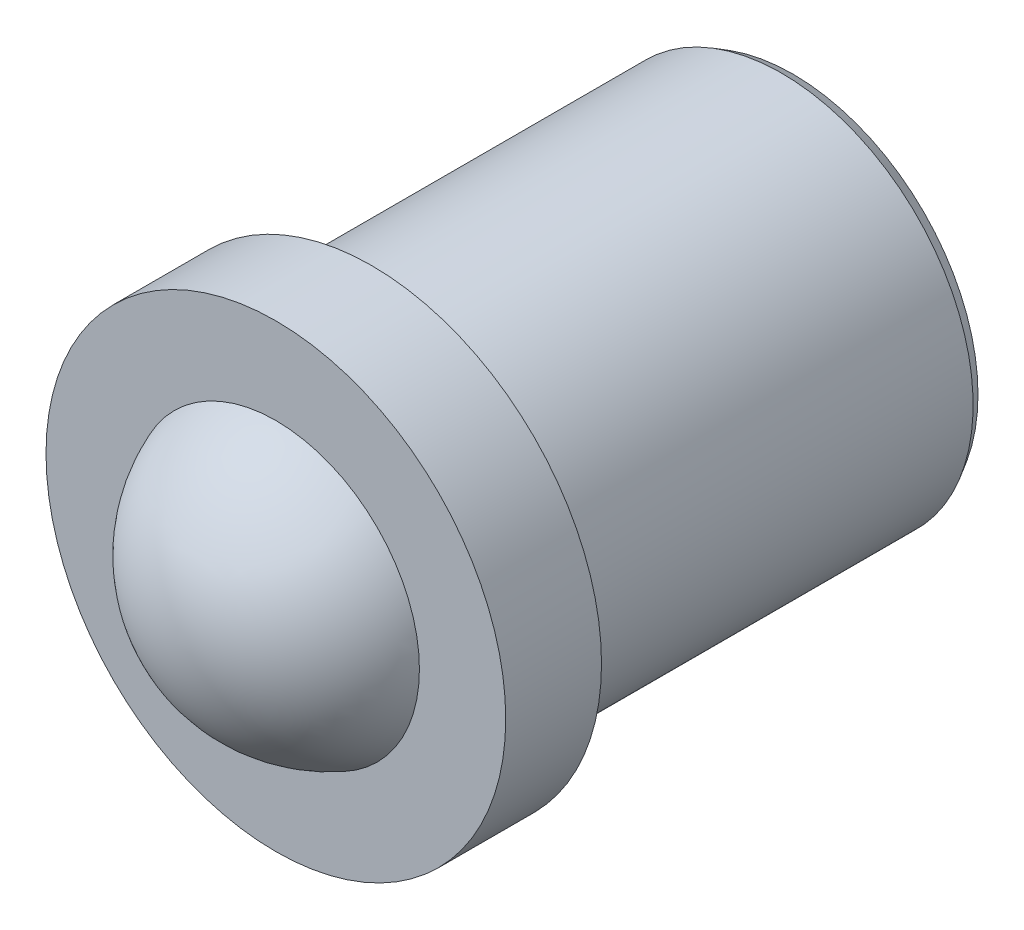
ISO-10303-21;
HEADER;
FILE_DESCRIPTION(('STEP AP214'),'2;1');
FILE_NAME('part.step','',(''),(''),'','','');
FILE_SCHEMA(('AUTOMOTIVE_DESIGN { 1 0 10303 214 1 1 1 1 }'));
ENDSEC;
DATA;
#1=APPLICATION_CONTEXT('core data for automotive mechanical design processes');
#2=APPLICATION_PROTOCOL_DEFINITION('international standard','automotive_design',2000,#1);
#3=PRODUCT_CONTEXT('',#1,'mechanical');
#4=PRODUCT('Part','Part','',(#3));
#5=PRODUCT_RELATED_PRODUCT_CATEGORY('part','',(#4));
#6=PRODUCT_DEFINITION_FORMATION('','',#4);
#7=PRODUCT_DEFINITION_CONTEXT('part definition',#1,'design');
#8=PRODUCT_DEFINITION('design','',#6,#7);
#9=PRODUCT_DEFINITION_SHAPE('','',#8);
#10=(LENGTH_UNIT() NAMED_UNIT(*) SI_UNIT(.MILLI.,.METRE.));
#11=(NAMED_UNIT(*) PLANE_ANGLE_UNIT() SI_UNIT($,.RADIAN.));
#12=(NAMED_UNIT(*) SI_UNIT($,.STERADIAN.) SOLID_ANGLE_UNIT());
#13=UNCERTAINTY_MEASURE_WITH_UNIT(LENGTH_MEASURE(1.E-05),#10,'distance_accuracy_value','');
#14=(GEOMETRIC_REPRESENTATION_CONTEXT(3) GLOBAL_UNCERTAINTY_ASSIGNED_CONTEXT((#13)) GLOBAL_UNIT_ASSIGNED_CONTEXT((#10,
#11,#12)) REPRESENTATION_CONTEXT('',''));
#15=CARTESIAN_POINT('',(0.,0.,0.));
#16=DIRECTION('',(0.,0.,1.));
#17=DIRECTION('',(1.,0.,0.));
#18=AXIS2_PLACEMENT_3D('',#15,#16,#17);
#19=CARTESIAN_POINT('',(0.,0.,-11.));
#20=DIRECTION('',(0.,0.,1.));
#21=DIRECTION('',(-1.,0.,0.));
#22=AXIS2_PLACEMENT_3D('',#19,#20,#21);
#23=PLANE('',#22);
#24=CARTESIAN_POINT('',(0.,0.,-11.));
#25=DIRECTION('',(0.,0.,1.));
#26=DIRECTION('',(-1.,0.,0.));
#27=AXIS2_PLACEMENT_3D('',#24,#25,#26);
#28=CIRCLE('',#27,4.82679491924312);
#29=CARTESIAN_POINT('',(-4.82679491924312,0.,-11.));
#30=VERTEX_POINT('',#29);
#31=EDGE_CURVE('E18',#30,#30,#28,.T.);
#32=ORIENTED_EDGE('',*,*,#31,.F.);
#33=EDGE_LOOP('',(#32));
#34=FACE_BOUND('',#33,.T.);
#35=ADVANCED_FACE('F12',(#34),#23,.F.);
#36=CARTESIAN_POINT('',(0.,0.,-11.));
#37=DIRECTION('',(0.,0.,1.));
#38=DIRECTION('',(-1.,0.,0.));
#39=AXIS2_PLACEMENT_3D('',#36,#37,#38);
#40=CONICAL_SURFACE('',#39,4.82679491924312,0.523598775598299);
#41=CARTESIAN_POINT('',(0.,0.,-10.7));
#42=DIRECTION('',(0.,0.,1.));
#43=DIRECTION('',(-1.,0.,0.));
#44=AXIS2_PLACEMENT_3D('',#41,#42,#43);
#45=CIRCLE('',#44,5.);
#46=CARTESIAN_POINT('',(-5.,0.,-10.7));
#47=VERTEX_POINT('',#46);
#48=EDGE_CURVE('E22',#47,#47,#45,.T.);
#49=ORIENTED_EDGE('',*,*,#48,.F.);
#50=EDGE_LOOP('',(#49));
#51=FACE_BOUND('',#50,.T.);
#52=ORIENTED_EDGE('',*,*,#31,.T.);
#53=EDGE_LOOP('',(#52));
#54=FACE_BOUND('',#53,.T.);
#55=ADVANCED_FACE('F55',(#51,#54),#40,.T.);
#56=CARTESIAN_POINT('',(0.,0.,2.5));
#57=DIRECTION('',(0.,0.,1.));
#58=DIRECTION('',(-1.,0.,0.));
#59=AXIS2_PLACEMENT_3D('',#56,#57,#58);
#60=CYLINDRICAL_SURFACE('',#59,5.);
#61=CARTESIAN_POINT('',(0.,0.,0.));
#62=DIRECTION('',(0.,0.,1.));
#63=DIRECTION('',(-1.,0.,0.));
#64=AXIS2_PLACEMENT_3D('',#61,#62,#63);
#65=CIRCLE('',#64,5.);
#66=CARTESIAN_POINT('',(-5.,0.,0.));
#67=VERTEX_POINT('',#66);
#68=EDGE_CURVE('E26',#67,#67,#65,.T.);
#69=ORIENTED_EDGE('',*,*,#68,.F.);
#70=EDGE_LOOP('',(#69));
#71=FACE_BOUND('',#70,.T.);
#72=ORIENTED_EDGE('',*,*,#48,.T.);
#73=EDGE_LOOP('',(#72));
#74=FACE_BOUND('',#73,.T.);
#75=ADVANCED_FACE('F49',(#71,#74),#60,.T.);
#76=CARTESIAN_POINT('',(-5.,0.,0.));
#77=DIRECTION('',(0.,0.,1.));
#78=DIRECTION('',(-1.,0.,0.));
#79=AXIS2_PLACEMENT_3D('',#76,#77,#78);
#80=PLANE('',#79);
#81=CARTESIAN_POINT('',(0.,0.,0.));
#82=DIRECTION('',(0.,0.,1.));
#83=DIRECTION('',(-1.,0.,0.));
#84=AXIS2_PLACEMENT_3D('',#81,#82,#83);
#85=CIRCLE('',#84,6.);
#86=CARTESIAN_POINT('',(-6.,0.,0.));
#87=VERTEX_POINT('',#86);
#88=EDGE_CURVE('E31',#87,#87,#85,.T.);
#89=ORIENTED_EDGE('',*,*,#88,.F.);
#90=EDGE_LOOP('',(#89));
#91=FACE_BOUND('',#90,.T.);
#92=ORIENTED_EDGE('',*,*,#68,.T.);
#93=EDGE_LOOP('',(#92));
#94=FACE_BOUND('',#93,.T.);
#95=ADVANCED_FACE('F43',(#91,#94),#80,.F.);
#96=CARTESIAN_POINT('',(0.,0.,2.5));
#97=DIRECTION('',(0.,0.,1.));
#98=DIRECTION('',(-1.,0.,0.));
#99=AXIS2_PLACEMENT_3D('',#96,#97,#98);
#100=CYLINDRICAL_SURFACE('',#99,6.);
#101=CARTESIAN_POINT('',(0.,0.,2.5));
#102=DIRECTION('',(0.,0.,1.));
#103=DIRECTION('',(-1.,0.,0.));
#104=AXIS2_PLACEMENT_3D('',#101,#102,#103);
#105=CIRCLE('',#104,6.);
#106=CARTESIAN_POINT('',(-6.,0.,2.5));
#107=VERTEX_POINT('',#106);
#108=EDGE_CURVE('E34',#107,#107,#105,.T.);
#109=ORIENTED_EDGE('',*,*,#108,.F.);
#110=EDGE_LOOP('',(#109));
#111=FACE_BOUND('',#110,.T.);
#112=ORIENTED_EDGE('',*,*,#88,.T.);
#113=EDGE_LOOP('',(#112));
#114=FACE_BOUND('',#113,.T.);
#115=ADVANCED_FACE('F40',(#111,#114),#100,.T.);
#116=CARTESIAN_POINT('',(-6.,0.,2.5));
#117=DIRECTION('',(0.,0.,-1.));
#118=DIRECTION('',(1.,0.,0.));
#119=AXIS2_PLACEMENT_3D('',#116,#117,#118);
#120=PLANE('',#119);
#121=ORIENTED_EDGE('',*,*,#108,.T.);
#122=EDGE_LOOP('',(#121));
#123=FACE_BOUND('',#122,.T.);
#124=CARTESIAN_POINT('',(0.,0.,2.5));
#125=DIRECTION('',(0.,0.,1.));
#126=DIRECTION('',(-1.,0.,0.));
#127=AXIS2_PLACEMENT_3D('',#124,#125,#126);
#128=CIRCLE('',#127,3.74699879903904);
#129=CARTESIAN_POINT('',(-3.74699879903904,0.,2.5));
#130=VERTEX_POINT('',#129);
#131=EDGE_CURVE('E8',#130,#130,#128,.F.);
#132=ORIENTED_EDGE('',*,*,#131,.T.);
#133=EDGE_LOOP('',(#132));
#134=FACE_BOUND('',#133,.T.);
#135=ADVANCED_FACE('F38',(#123,#134),#120,.F.);
#136=CARTESIAN_POINT('',(0.,0.,1.1));
#137=DIRECTION('',(0.,0.,-1.));
#138=DIRECTION('',(1.,0.,0.));
#139=AXIS2_PLACEMENT_3D('',#136,#137,#138);
#140=SPHERICAL_SURFACE('',#139,4.);
#141=ORIENTED_EDGE('',*,*,#131,.F.);
#142=EDGE_LOOP('',(#141));
#143=FACE_BOUND('',#142,.T.);
#144=ADVANCED_FACE('F68',(#143),#140,.T.);
#145=CLOSED_SHELL('',(#35,#55,#75,#95,#115,#135,#144));
#146=MANIFOLD_SOLID_BREP('B1',#145);
#147=ADVANCED_BREP_SHAPE_REPRESENTATION('',(#18,#146),#14);
#148=SHAPE_DEFINITION_REPRESENTATION(#9,#147);
ENDSEC;
END-ISO-10303-21;
